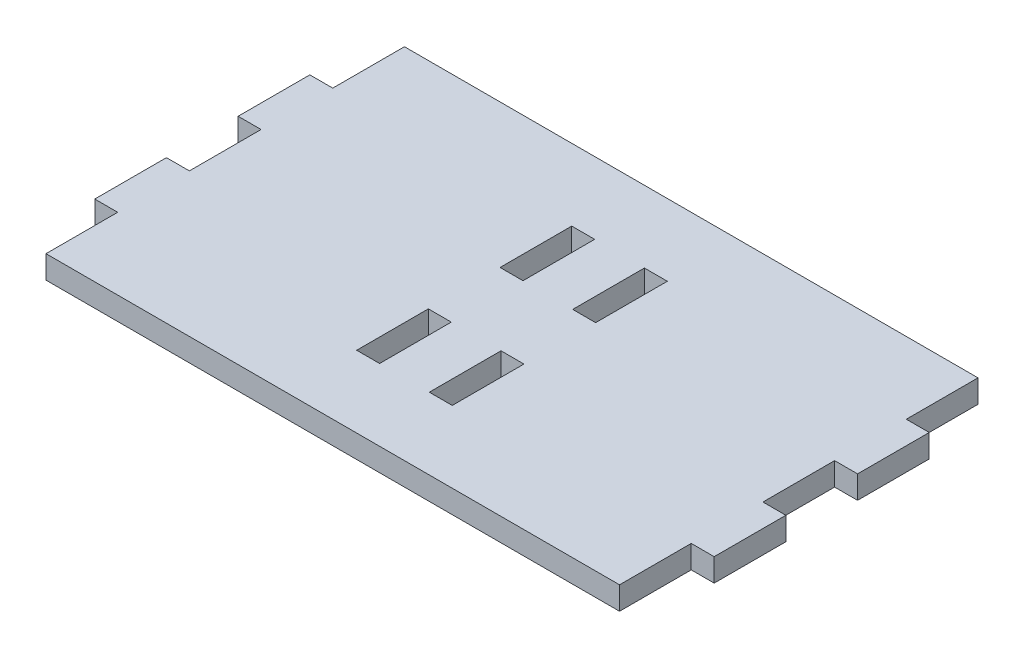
ISO-10303-21;
HEADER;
FILE_DESCRIPTION(('STEP AP214'),'2;1');
FILE_NAME('part.step','',(''),(''),'','','');
FILE_SCHEMA(('AUTOMOTIVE_DESIGN { 1 0 10303 214 1 1 1 1 }'));
ENDSEC;
DATA;
#1=APPLICATION_CONTEXT('core data for automotive mechanical design processes');
#2=APPLICATION_PROTOCOL_DEFINITION('international standard','automotive_design',2000,#1);
#3=PRODUCT_CONTEXT('',#1,'mechanical');
#4=PRODUCT('Part','Part','',(#3));
#5=PRODUCT_RELATED_PRODUCT_CATEGORY('part','',(#4));
#6=PRODUCT_DEFINITION_FORMATION('','',#4);
#7=PRODUCT_DEFINITION_CONTEXT('part definition',#1,'design');
#8=PRODUCT_DEFINITION('design','',#6,#7);
#9=PRODUCT_DEFINITION_SHAPE('','',#8);
#10=(LENGTH_UNIT() NAMED_UNIT(*) SI_UNIT(.MILLI.,.METRE.));
#11=(NAMED_UNIT(*) PLANE_ANGLE_UNIT() SI_UNIT($,.RADIAN.));
#12=(NAMED_UNIT(*) SI_UNIT($,.STERADIAN.) SOLID_ANGLE_UNIT());
#13=UNCERTAINTY_MEASURE_WITH_UNIT(LENGTH_MEASURE(1.E-05),#10,'distance_accuracy_value','');
#14=(GEOMETRIC_REPRESENTATION_CONTEXT(3) GLOBAL_UNCERTAINTY_ASSIGNED_CONTEXT((#13)) GLOBAL_UNIT_ASSIGNED_CONTEXT((#10,
#11,#12)) REPRESENTATION_CONTEXT('',''));
#15=CARTESIAN_POINT('',(0.,0.,0.));
#16=DIRECTION('',(0.,0.,1.));
#17=DIRECTION('',(1.,0.,0.));
#18=AXIS2_PLACEMENT_3D('',#15,#16,#17);
#19=CARTESIAN_POINT('',(0.,12.,0.));
#20=DIRECTION('',(0.,-1.,0.));
#21=DIRECTION('',(0.,0.,-1.));
#22=AXIS2_PLACEMENT_3D('',#19,#20,#21);
#23=PLANE('',#22);
#24=DIRECTION('',(-1.,0.,0.));
#25=VECTOR('',#24,1.);
#26=CARTESIAN_POINT('',(-24.9999999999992,12.,18.75));
#27=LINE('',#26,#25);
#28=CARTESIAN_POINT('',(-12.9999999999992,12.,18.75));
#29=VERTEX_POINT('',#28);
#30=CARTESIAN_POINT('',(-24.9999999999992,12.,18.75));
#31=VERTEX_POINT('',#30);
#32=EDGE_CURVE('E327',#29,#31,#27,.T.);
#33=ORIENTED_EDGE('',*,*,#32,.F.);
#34=DIRECTION('',(0.,0.,-1.));
#35=VECTOR('',#34,1.);
#36=CARTESIAN_POINT('',(-12.9999999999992,12.,18.75));
#37=LINE('',#36,#35);
#38=CARTESIAN_POINT('',(-12.9999999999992,12.,56.25));
#39=VERTEX_POINT('',#38);
#40=EDGE_CURVE('E338',#39,#29,#37,.T.);
#41=ORIENTED_EDGE('',*,*,#40,.F.);
#42=DIRECTION('',(1.,0.,0.));
#43=VECTOR('',#42,1.);
#44=CARTESIAN_POINT('',(-24.9999999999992,12.,56.25));
#45=LINE('',#44,#43);
#46=CARTESIAN_POINT('',(-24.9999999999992,12.,56.25));
#47=VERTEX_POINT('',#46);
#48=EDGE_CURVE('E334',#47,#39,#45,.T.);
#49=ORIENTED_EDGE('',*,*,#48,.F.);
#50=DIRECTION('',(0.,0.,1.));
#51=VECTOR('',#50,1.);
#52=CARTESIAN_POINT('',(-24.9999999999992,12.,18.75));
#53=LINE('',#52,#51);
#54=EDGE_CURVE('E330',#31,#47,#53,.T.);
#55=ORIENTED_EDGE('',*,*,#54,.F.);
#56=EDGE_LOOP('',(#33,#41,#49,#55));
#57=FACE_BOUND('',#56,.T.);
#58=DIRECTION('',(0.,0.,1.));
#59=VECTOR('',#58,1.);
#60=CARTESIAN_POINT('',(-25.,12.,-56.25));
#61=LINE('',#60,#59);
#62=CARTESIAN_POINT('',(-25.,12.,-56.25));
#63=VERTEX_POINT('',#62);
#64=CARTESIAN_POINT('',(-25.,12.,-18.75));
#65=VERTEX_POINT('',#64);
#66=EDGE_CURVE('E413',#63,#65,#61,.T.);
#67=ORIENTED_EDGE('',*,*,#66,.F.);
#68=DIRECTION('',(-1.,0.,0.));
#69=VECTOR('',#68,1.);
#70=CARTESIAN_POINT('',(-25.,12.,-56.25));
#71=LINE('',#70,#69);
#72=CARTESIAN_POINT('',(-13.,12.,-56.25));
#73=VERTEX_POINT('',#72);
#74=EDGE_CURVE('E424',#73,#63,#71,.T.);
#75=ORIENTED_EDGE('',*,*,#74,.F.);
#76=DIRECTION('',(0.,0.,-1.));
#77=VECTOR('',#76,1.);
#78=CARTESIAN_POINT('',(-13.,12.,-56.25));
#79=LINE('',#78,#77);
#80=CARTESIAN_POINT('',(-13.,12.,-18.75));
#81=VERTEX_POINT('',#80);
#82=EDGE_CURVE('E420',#81,#73,#79,.T.);
#83=ORIENTED_EDGE('',*,*,#82,.F.);
#84=DIRECTION('',(1.,0.,0.));
#85=VECTOR('',#84,1.);
#86=CARTESIAN_POINT('',(-25.,12.,-18.75));
#87=LINE('',#86,#85);
#88=EDGE_CURVE('E416',#65,#81,#87,.T.);
#89=ORIENTED_EDGE('',*,*,#88,.F.);
#90=EDGE_LOOP('',(#67,#75,#83,#89));
#91=FACE_BOUND('',#90,.T.);
#92=DIRECTION('',(0.,0.,-1.));
#93=VECTOR('',#92,1.);
#94=CARTESIAN_POINT('',(150.,12.,-56.25));
#95=LINE('',#94,#93);
#96=CARTESIAN_POINT('',(150.,12.,-56.25));
#97=VERTEX_POINT('',#96);
#98=CARTESIAN_POINT('',(150.,12.,-93.75));
#99=VERTEX_POINT('',#98);
#100=EDGE_CURVE('E456',#97,#99,#95,.T.);
#101=ORIENTED_EDGE('',*,*,#100,.T.);
#102=DIRECTION('',(-1.,0.,0.));
#103=VECTOR('',#102,1.);
#104=CARTESIAN_POINT('',(-150.,12.,-93.75));
#105=LINE('',#104,#103);
#106=CARTESIAN_POINT('',(-150.,12.,-93.75));
#107=VERTEX_POINT('',#106);
#108=EDGE_CURVE('E460',#99,#107,#105,.T.);
#109=ORIENTED_EDGE('',*,*,#108,.T.);
#110=DIRECTION('',(0.,0.,1.));
#111=VECTOR('',#110,1.);
#112=CARTESIAN_POINT('',(-150.,12.,-56.25));
#113=LINE('',#112,#111);
#114=CARTESIAN_POINT('',(-150.,12.,-56.25));
#115=VERTEX_POINT('',#114);
#116=EDGE_CURVE('E464',#107,#115,#113,.T.);
#117=ORIENTED_EDGE('',*,*,#116,.T.);
#118=DIRECTION('',(-1.,0.,0.));
#119=VECTOR('',#118,1.);
#120=CARTESIAN_POINT('',(-150.,12.,-56.25));
#121=LINE('',#120,#119);
#122=CARTESIAN_POINT('',(-162.,12.,-56.25));
#123=VERTEX_POINT('',#122);
#124=EDGE_CURVE('E467',#115,#123,#121,.T.);
#125=ORIENTED_EDGE('',*,*,#124,.T.);
#126=DIRECTION('',(0.,0.,1.));
#127=VECTOR('',#126,1.);
#128=CARTESIAN_POINT('',(-162.,12.,-18.75));
#129=LINE('',#128,#127);
#130=CARTESIAN_POINT('',(-162.,12.,-18.75));
#131=VERTEX_POINT('',#130);
#132=EDGE_CURVE('E470',#123,#131,#129,.T.);
#133=ORIENTED_EDGE('',*,*,#132,.T.);
#134=DIRECTION('',(1.,0.,0.));
#135=VECTOR('',#134,1.);
#136=CARTESIAN_POINT('',(-150.,12.,-18.75));
#137=LINE('',#136,#135);
#138=CARTESIAN_POINT('',(-150.,12.,-18.75));
#139=VERTEX_POINT('',#138);
#140=EDGE_CURVE('E473',#131,#139,#137,.T.);
#141=ORIENTED_EDGE('',*,*,#140,.T.);
#142=DIRECTION('',(0.,0.,1.));
#143=VECTOR('',#142,1.);
#144=CARTESIAN_POINT('',(-150.,12.,18.75));
#145=LINE('',#144,#143);
#146=CARTESIAN_POINT('',(-150.,12.,18.75));
#147=VERTEX_POINT('',#146);
#148=EDGE_CURVE('E476',#139,#147,#145,.T.);
#149=ORIENTED_EDGE('',*,*,#148,.T.);
#150=DIRECTION('',(-1.,0.,0.));
#151=VECTOR('',#150,1.);
#152=CARTESIAN_POINT('',(-150.,12.,18.75));
#153=LINE('',#152,#151);
#154=CARTESIAN_POINT('',(-162.,12.,18.75));
#155=VERTEX_POINT('',#154);
#156=EDGE_CURVE('E479',#147,#155,#153,.T.);
#157=ORIENTED_EDGE('',*,*,#156,.T.);
#158=DIRECTION('',(0.,0.,1.));
#159=VECTOR('',#158,1.);
#160=CARTESIAN_POINT('',(-162.,12.,56.25));
#161=LINE('',#160,#159);
#162=CARTESIAN_POINT('',(-162.,12.,56.25));
#163=VERTEX_POINT('',#162);
#164=EDGE_CURVE('E482',#155,#163,#161,.T.);
#165=ORIENTED_EDGE('',*,*,#164,.T.);
#166=DIRECTION('',(1.,0.,0.));
#167=VECTOR('',#166,1.);
#168=CARTESIAN_POINT('',(-150.,12.,56.25));
#169=LINE('',#168,#167);
#170=CARTESIAN_POINT('',(-150.,12.,56.25));
#171=VERTEX_POINT('',#170);
#172=EDGE_CURVE('E485',#163,#171,#169,.T.);
#173=ORIENTED_EDGE('',*,*,#172,.T.);
#174=DIRECTION('',(0.,0.,1.));
#175=VECTOR('',#174,1.);
#176=CARTESIAN_POINT('',(-150.,12.,93.75));
#177=LINE('',#176,#175);
#178=CARTESIAN_POINT('',(-150.,12.,93.75));
#179=VERTEX_POINT('',#178);
#180=EDGE_CURVE('E488',#171,#179,#177,.T.);
#181=ORIENTED_EDGE('',*,*,#180,.T.);
#182=DIRECTION('',(1.,0.,0.));
#183=VECTOR('',#182,1.);
#184=CARTESIAN_POINT('',(-150.,12.,93.75));
#185=LINE('',#184,#183);
#186=CARTESIAN_POINT('',(150.,12.,93.75));
#187=VERTEX_POINT('',#186);
#188=EDGE_CURVE('E491',#179,#187,#185,.T.);
#189=ORIENTED_EDGE('',*,*,#188,.T.);
#190=DIRECTION('',(0.,0.,-1.));
#191=VECTOR('',#190,1.);
#192=CARTESIAN_POINT('',(150.,12.,93.75));
#193=LINE('',#192,#191);
#194=CARTESIAN_POINT('',(150.,12.,56.25));
#195=VERTEX_POINT('',#194);
#196=EDGE_CURVE('E494',#187,#195,#193,.T.);
#197=ORIENTED_EDGE('',*,*,#196,.T.);
#198=DIRECTION('',(1.,0.,0.));
#199=VECTOR('',#198,1.);
#200=CARTESIAN_POINT('',(150.,12.,56.25));
#201=LINE('',#200,#199);
#202=CARTESIAN_POINT('',(162.,12.,56.25));
#203=VERTEX_POINT('',#202);
#204=EDGE_CURVE('E497',#195,#203,#201,.T.);
#205=ORIENTED_EDGE('',*,*,#204,.T.);
#206=DIRECTION('',(0.,0.,-1.));
#207=VECTOR('',#206,1.);
#208=CARTESIAN_POINT('',(162.,12.,56.25));
#209=LINE('',#208,#207);
#210=CARTESIAN_POINT('',(162.,12.,18.75));
#211=VERTEX_POINT('',#210);
#212=EDGE_CURVE('E500',#203,#211,#209,.T.);
#213=ORIENTED_EDGE('',*,*,#212,.T.);
#214=DIRECTION('',(-1.,0.,0.));
#215=VECTOR('',#214,1.);
#216=CARTESIAN_POINT('',(150.,12.,18.75));
#217=LINE('',#216,#215);
#218=CARTESIAN_POINT('',(150.,12.,18.75));
#219=VERTEX_POINT('',#218);
#220=EDGE_CURVE('E503',#211,#219,#217,.T.);
#221=ORIENTED_EDGE('',*,*,#220,.T.);
#222=DIRECTION('',(0.,0.,-1.));
#223=VECTOR('',#222,1.);
#224=CARTESIAN_POINT('',(150.,12.,18.75));
#225=LINE('',#224,#223);
#226=CARTESIAN_POINT('',(150.,12.,-18.75));
#227=VERTEX_POINT('',#226);
#228=EDGE_CURVE('E506',#219,#227,#225,.T.);
#229=ORIENTED_EDGE('',*,*,#228,.T.);
#230=DIRECTION('',(1.,0.,0.));
#231=VECTOR('',#230,1.);
#232=CARTESIAN_POINT('',(150.,12.,-18.75));
#233=LINE('',#232,#231);
#234=CARTESIAN_POINT('',(162.,12.,-18.75));
#235=VERTEX_POINT('',#234);
#236=EDGE_CURVE('E509',#227,#235,#233,.T.);
#237=ORIENTED_EDGE('',*,*,#236,.T.);
#238=DIRECTION('',(0.,0.,-1.));
#239=VECTOR('',#238,1.);
#240=CARTESIAN_POINT('',(162.,12.,-18.75));
#241=LINE('',#240,#239);
#242=CARTESIAN_POINT('',(162.,12.,-56.25));
#243=VERTEX_POINT('',#242);
#244=EDGE_CURVE('E512',#235,#243,#241,.T.);
#245=ORIENTED_EDGE('',*,*,#244,.T.);
#246=DIRECTION('',(-1.,0.,0.));
#247=VECTOR('',#246,1.);
#248=CARTESIAN_POINT('',(150.,12.,-56.25));
#249=LINE('',#248,#247);
#250=EDGE_CURVE('E515',#243,#97,#249,.T.);
#251=ORIENTED_EDGE('',*,*,#250,.T.);
#252=EDGE_LOOP('',(#101,#109,#117,#125,#133,#141,#149,#157,#165,#173,#181,#189,#197,#205,#213,
#221,#229,#237,#245,#251));
#253=FACE_BOUND('',#252,.T.);
#254=DIRECTION('',(0.,0.,-1.));
#255=VECTOR('',#254,1.);
#256=CARTESIAN_POINT('',(24.9999999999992,12.,18.75));
#257=LINE('',#256,#255);
#258=CARTESIAN_POINT('',(24.9999999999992,12.,56.25));
#259=VERTEX_POINT('',#258);
#260=CARTESIAN_POINT('',(24.9999999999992,12.,18.75));
#261=VERTEX_POINT('',#260);
#262=EDGE_CURVE('E370',#259,#261,#257,.T.);
#263=ORIENTED_EDGE('',*,*,#262,.F.);
#264=DIRECTION('',(1.,0.,0.));
#265=VECTOR('',#264,1.);
#266=CARTESIAN_POINT('',(24.9999999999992,12.,56.25));
#267=LINE('',#266,#265);
#268=CARTESIAN_POINT('',(12.9999999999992,12.,56.25));
#269=VERTEX_POINT('',#268);
#270=EDGE_CURVE('E381',#269,#259,#267,.T.);
#271=ORIENTED_EDGE('',*,*,#270,.F.);
#272=DIRECTION('',(0.,0.,1.));
#273=VECTOR('',#272,1.);
#274=CARTESIAN_POINT('',(12.9999999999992,12.,18.75));
#275=LINE('',#274,#273);
#276=CARTESIAN_POINT('',(12.9999999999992,12.,18.75));
#277=VERTEX_POINT('',#276);
#278=EDGE_CURVE('E377',#277,#269,#275,.T.);
#279=ORIENTED_EDGE('',*,*,#278,.F.);
#280=DIRECTION('',(-1.,0.,0.));
#281=VECTOR('',#280,1.);
#282=CARTESIAN_POINT('',(24.9999999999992,12.,18.75));
#283=LINE('',#282,#281);
#284=EDGE_CURVE('E373',#261,#277,#283,.T.);
#285=ORIENTED_EDGE('',*,*,#284,.F.);
#286=EDGE_LOOP('',(#263,#271,#279,#285));
#287=FACE_BOUND('',#286,.T.);
#288=DIRECTION('',(0.,0.,-1.));
#289=VECTOR('',#288,1.);
#290=CARTESIAN_POINT('',(25.,12.,-56.25));
#291=LINE('',#290,#289);
#292=CARTESIAN_POINT('',(25.,12.,-18.75));
#293=VERTEX_POINT('',#292);
#294=CARTESIAN_POINT('',(25.,12.,-56.25));
#295=VERTEX_POINT('',#294);
#296=EDGE_CURVE('E279',#293,#295,#291,.T.);
#297=ORIENTED_EDGE('',*,*,#296,.F.);
#298=DIRECTION('',(1.,0.,0.));
#299=VECTOR('',#298,1.);
#300=CARTESIAN_POINT('',(25.,12.,-18.75));
#301=LINE('',#300,#299);
#302=CARTESIAN_POINT('',(13.,12.,-18.75));
#303=VERTEX_POINT('',#302);
#304=EDGE_CURVE('E305',#303,#293,#301,.T.);
#305=ORIENTED_EDGE('',*,*,#304,.F.);
#306=DIRECTION('',(0.,0.,1.));
#307=VECTOR('',#306,1.);
#308=CARTESIAN_POINT('',(13.,12.,-56.25));
#309=LINE('',#308,#307);
#310=CARTESIAN_POINT('',(13.,12.,-56.25));
#311=VERTEX_POINT('',#310);
#312=EDGE_CURVE('E301',#311,#303,#309,.T.);
#313=ORIENTED_EDGE('',*,*,#312,.F.);
#314=DIRECTION('',(-1.,0.,0.));
#315=VECTOR('',#314,1.);
#316=CARTESIAN_POINT('',(25.,12.,-56.25));
#317=LINE('',#316,#315);
#318=EDGE_CURVE('E288',#295,#311,#317,.T.);
#319=ORIENTED_EDGE('',*,*,#318,.F.);
#320=EDGE_LOOP('',(#297,#305,#313,#319));
#321=FACE_BOUND('',#320,.T.);
#322=ADVANCED_FACE('F45',(#57,#91,#253,#287,#321),#23,.F.);
#323=CARTESIAN_POINT('',(0.,0.,0.));
#324=DIRECTION('',(0.,-1.,0.));
#325=DIRECTION('',(0.,0.,-1.));
#326=AXIS2_PLACEMENT_3D('',#323,#324,#325);
#327=PLANE('',#326);
#328=DIRECTION('',(0.,0.,-1.));
#329=VECTOR('',#328,1.);
#330=CARTESIAN_POINT('',(150.,0.,-56.25));
#331=LINE('',#330,#329);
#332=CARTESIAN_POINT('',(150.,0.,-56.25));
#333=VERTEX_POINT('',#332);
#334=CARTESIAN_POINT('',(150.,0.,-93.75));
#335=VERTEX_POINT('',#334);
#336=EDGE_CURVE('E455',#333,#335,#331,.T.);
#337=ORIENTED_EDGE('',*,*,#336,.F.);
#338=DIRECTION('',(-1.,0.,0.));
#339=VECTOR('',#338,1.);
#340=CARTESIAN_POINT('',(150.,0.,-56.25));
#341=LINE('',#340,#339);
#342=CARTESIAN_POINT('',(162.,0.,-56.25));
#343=VERTEX_POINT('',#342);
#344=EDGE_CURVE('E461',#343,#333,#341,.T.);
#345=ORIENTED_EDGE('',*,*,#344,.F.);
#346=DIRECTION('',(0.,0.,-1.));
#347=VECTOR('',#346,1.);
#348=CARTESIAN_POINT('',(162.,0.,-18.75));
#349=LINE('',#348,#347);
#350=CARTESIAN_POINT('',(162.,0.,-18.75));
#351=VERTEX_POINT('',#350);
#352=EDGE_CURVE('E573',#351,#343,#349,.T.);
#353=ORIENTED_EDGE('',*,*,#352,.F.);
#354=DIRECTION('',(1.,0.,0.));
#355=VECTOR('',#354,1.);
#356=CARTESIAN_POINT('',(150.,0.,-18.75));
#357=LINE('',#356,#355);
#358=CARTESIAN_POINT('',(150.,0.,-18.75));
#359=VERTEX_POINT('',#358);
#360=EDGE_CURVE('E570',#359,#351,#357,.T.);
#361=ORIENTED_EDGE('',*,*,#360,.F.);
#362=DIRECTION('',(0.,0.,-1.));
#363=VECTOR('',#362,1.);
#364=CARTESIAN_POINT('',(150.,0.,18.75));
#365=LINE('',#364,#363);
#366=CARTESIAN_POINT('',(150.,0.,18.75));
#367=VERTEX_POINT('',#366);
#368=EDGE_CURVE('E567',#367,#359,#365,.T.);
#369=ORIENTED_EDGE('',*,*,#368,.F.);
#370=DIRECTION('',(-1.,0.,0.));
#371=VECTOR('',#370,1.);
#372=CARTESIAN_POINT('',(150.,0.,18.75));
#373=LINE('',#372,#371);
#374=CARTESIAN_POINT('',(162.,0.,18.75));
#375=VERTEX_POINT('',#374);
#376=EDGE_CURVE('E564',#375,#367,#373,.T.);
#377=ORIENTED_EDGE('',*,*,#376,.F.);
#378=DIRECTION('',(0.,0.,-1.));
#379=VECTOR('',#378,1.);
#380=CARTESIAN_POINT('',(162.,0.,56.25));
#381=LINE('',#380,#379);
#382=CARTESIAN_POINT('',(162.,0.,56.25));
#383=VERTEX_POINT('',#382);
#384=EDGE_CURVE('E561',#383,#375,#381,.T.);
#385=ORIENTED_EDGE('',*,*,#384,.F.);
#386=DIRECTION('',(1.,0.,0.));
#387=VECTOR('',#386,1.);
#388=CARTESIAN_POINT('',(150.,0.,56.25));
#389=LINE('',#388,#387);
#390=CARTESIAN_POINT('',(150.,0.,56.25));
#391=VERTEX_POINT('',#390);
#392=EDGE_CURVE('E558',#391,#383,#389,.T.);
#393=ORIENTED_EDGE('',*,*,#392,.F.);
#394=DIRECTION('',(0.,0.,-1.));
#395=VECTOR('',#394,1.);
#396=CARTESIAN_POINT('',(150.,0.,93.75));
#397=LINE('',#396,#395);
#398=CARTESIAN_POINT('',(150.,0.,93.75));
#399=VERTEX_POINT('',#398);
#400=EDGE_CURVE('E555',#399,#391,#397,.T.);
#401=ORIENTED_EDGE('',*,*,#400,.F.);
#402=DIRECTION('',(1.,0.,0.));
#403=VECTOR('',#402,1.);
#404=CARTESIAN_POINT('',(-150.,0.,93.75));
#405=LINE('',#404,#403);
#406=CARTESIAN_POINT('',(-150.,0.,93.75));
#407=VERTEX_POINT('',#406);
#408=EDGE_CURVE('E552',#407,#399,#405,.T.);
#409=ORIENTED_EDGE('',*,*,#408,.F.);
#410=DIRECTION('',(0.,0.,1.));
#411=VECTOR('',#410,1.);
#412=CARTESIAN_POINT('',(-150.,0.,93.75));
#413=LINE('',#412,#411);
#414=CARTESIAN_POINT('',(-150.,0.,56.25));
#415=VERTEX_POINT('',#414);
#416=EDGE_CURVE('E549',#415,#407,#413,.T.);
#417=ORIENTED_EDGE('',*,*,#416,.F.);
#418=DIRECTION('',(1.,0.,0.));
#419=VECTOR('',#418,1.);
#420=CARTESIAN_POINT('',(-150.,0.,56.25));
#421=LINE('',#420,#419);
#422=CARTESIAN_POINT('',(-162.,0.,56.25));
#423=VERTEX_POINT('',#422);
#424=EDGE_CURVE('E546',#423,#415,#421,.T.);
#425=ORIENTED_EDGE('',*,*,#424,.F.);
#426=DIRECTION('',(0.,0.,1.));
#427=VECTOR('',#426,1.);
#428=CARTESIAN_POINT('',(-162.,0.,56.25));
#429=LINE('',#428,#427);
#430=CARTESIAN_POINT('',(-162.,0.,18.75));
#431=VERTEX_POINT('',#430);
#432=EDGE_CURVE('E543',#431,#423,#429,.T.);
#433=ORIENTED_EDGE('',*,*,#432,.F.);
#434=DIRECTION('',(-1.,0.,0.));
#435=VECTOR('',#434,1.);
#436=CARTESIAN_POINT('',(-150.,0.,18.75));
#437=LINE('',#436,#435);
#438=CARTESIAN_POINT('',(-150.,0.,18.75));
#439=VERTEX_POINT('',#438);
#440=EDGE_CURVE('E540',#439,#431,#437,.T.);
#441=ORIENTED_EDGE('',*,*,#440,.F.);
#442=DIRECTION('',(0.,0.,1.));
#443=VECTOR('',#442,1.);
#444=CARTESIAN_POINT('',(-150.,0.,18.75));
#445=LINE('',#444,#443);
#446=CARTESIAN_POINT('',(-150.,0.,-18.75));
#447=VERTEX_POINT('',#446);
#448=EDGE_CURVE('E537',#447,#439,#445,.T.);
#449=ORIENTED_EDGE('',*,*,#448,.F.);
#450=DIRECTION('',(1.,0.,0.));
#451=VECTOR('',#450,1.);
#452=CARTESIAN_POINT('',(-150.,0.,-18.75));
#453=LINE('',#452,#451);
#454=CARTESIAN_POINT('',(-162.,0.,-18.75));
#455=VERTEX_POINT('',#454);
#456=EDGE_CURVE('E534',#455,#447,#453,.T.);
#457=ORIENTED_EDGE('',*,*,#456,.F.);
#458=DIRECTION('',(0.,0.,1.));
#459=VECTOR('',#458,1.);
#460=CARTESIAN_POINT('',(-162.,0.,-18.75));
#461=LINE('',#460,#459);
#462=CARTESIAN_POINT('',(-162.,0.,-56.25));
#463=VERTEX_POINT('',#462);
#464=EDGE_CURVE('E531',#463,#455,#461,.T.);
#465=ORIENTED_EDGE('',*,*,#464,.F.);
#466=DIRECTION('',(-1.,0.,0.));
#467=VECTOR('',#466,1.);
#468=CARTESIAN_POINT('',(-150.,0.,-56.25));
#469=LINE('',#468,#467);
#470=CARTESIAN_POINT('',(-150.,0.,-56.25));
#471=VERTEX_POINT('',#470);
#472=EDGE_CURVE('E528',#471,#463,#469,.T.);
#473=ORIENTED_EDGE('',*,*,#472,.F.);
#474=DIRECTION('',(0.,0.,1.));
#475=VECTOR('',#474,1.);
#476=CARTESIAN_POINT('',(-150.,0.,-56.25));
#477=LINE('',#476,#475);
#478=CARTESIAN_POINT('',(-150.,0.,-93.75));
#479=VERTEX_POINT('',#478);
#480=EDGE_CURVE('E525',#479,#471,#477,.T.);
#481=ORIENTED_EDGE('',*,*,#480,.F.);
#482=DIRECTION('',(-1.,0.,0.));
#483=VECTOR('',#482,1.);
#484=CARTESIAN_POINT('',(-150.,0.,-93.75));
#485=LINE('',#484,#483);
#486=EDGE_CURVE('E522',#335,#479,#485,.T.);
#487=ORIENTED_EDGE('',*,*,#486,.F.);
#488=EDGE_LOOP('',(#337,#345,#353,#361,#369,#377,#385,#393,#401,#409,#417,#425,#433,#441,#449,
#457,#465,#473,#481,#487));
#489=FACE_BOUND('',#488,.T.);
#490=DIRECTION('',(-1.,0.,0.));
#491=VECTOR('',#490,1.);
#492=CARTESIAN_POINT('',(-25.,0.,-56.25));
#493=LINE('',#492,#491);
#494=CARTESIAN_POINT('',(-13.,0.,-56.25));
#495=VERTEX_POINT('',#494);
#496=CARTESIAN_POINT('',(-25.,0.,-56.25));
#497=VERTEX_POINT('',#496);
#498=EDGE_CURVE('E417',#495,#497,#493,.T.);
#499=ORIENTED_EDGE('',*,*,#498,.T.);
#500=DIRECTION('',(0.,0.,1.));
#501=VECTOR('',#500,1.);
#502=CARTESIAN_POINT('',(-25.,0.,-56.25));
#503=LINE('',#502,#501);
#504=CARTESIAN_POINT('',(-25.,0.,-18.75));
#505=VERTEX_POINT('',#504);
#506=EDGE_CURVE('E412',#497,#505,#503,.T.);
#507=ORIENTED_EDGE('',*,*,#506,.T.);
#508=DIRECTION('',(1.,0.,0.));
#509=VECTOR('',#508,1.);
#510=CARTESIAN_POINT('',(-25.,0.,-18.75));
#511=LINE('',#510,#509);
#512=CARTESIAN_POINT('',(-13.,0.,-18.75));
#513=VERTEX_POINT('',#512);
#514=EDGE_CURVE('E431',#505,#513,#511,.T.);
#515=ORIENTED_EDGE('',*,*,#514,.T.);
#516=DIRECTION('',(0.,0.,-1.));
#517=VECTOR('',#516,1.);
#518=CARTESIAN_POINT('',(-13.,0.,-56.25));
#519=LINE('',#518,#517);
#520=EDGE_CURVE('E435',#513,#495,#519,.T.);
#521=ORIENTED_EDGE('',*,*,#520,.T.);
#522=EDGE_LOOP('',(#499,#507,#515,#521));
#523=FACE_BOUND('',#522,.T.);
#524=DIRECTION('',(1.,0.,0.));
#525=VECTOR('',#524,1.);
#526=CARTESIAN_POINT('',(24.9999999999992,0.,56.25));
#527=LINE('',#526,#525);
#528=CARTESIAN_POINT('',(12.9999999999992,0.,56.25));
#529=VERTEX_POINT('',#528);
#530=CARTESIAN_POINT('',(24.9999999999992,0.,56.25));
#531=VERTEX_POINT('',#530);
#532=EDGE_CURVE('E374',#529,#531,#527,.T.);
#533=ORIENTED_EDGE('',*,*,#532,.T.);
#534=DIRECTION('',(0.,0.,-1.));
#535=VECTOR('',#534,1.);
#536=CARTESIAN_POINT('',(24.9999999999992,0.,18.75));
#537=LINE('',#536,#535);
#538=CARTESIAN_POINT('',(24.9999999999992,0.,18.75));
#539=VERTEX_POINT('',#538);
#540=EDGE_CURVE('E369',#531,#539,#537,.T.);
#541=ORIENTED_EDGE('',*,*,#540,.T.);
#542=DIRECTION('',(-1.,0.,0.));
#543=VECTOR('',#542,1.);
#544=CARTESIAN_POINT('',(24.9999999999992,0.,18.75));
#545=LINE('',#544,#543);
#546=CARTESIAN_POINT('',(12.9999999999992,0.,18.75));
#547=VERTEX_POINT('',#546);
#548=EDGE_CURVE('E388',#539,#547,#545,.T.);
#549=ORIENTED_EDGE('',*,*,#548,.T.);
#550=DIRECTION('',(0.,0.,1.));
#551=VECTOR('',#550,1.);
#552=CARTESIAN_POINT('',(12.9999999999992,0.,18.75));
#553=LINE('',#552,#551);
#554=EDGE_CURVE('E392',#547,#529,#553,.T.);
#555=ORIENTED_EDGE('',*,*,#554,.T.);
#556=EDGE_LOOP('',(#533,#541,#549,#555));
#557=FACE_BOUND('',#556,.T.);
#558=DIRECTION('',(0.,0.,-1.));
#559=VECTOR('',#558,1.);
#560=CARTESIAN_POINT('',(-12.9999999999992,0.,18.75));
#561=LINE('',#560,#559);
#562=CARTESIAN_POINT('',(-12.9999999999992,0.,56.25));
#563=VERTEX_POINT('',#562);
#564=CARTESIAN_POINT('',(-12.9999999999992,0.,18.75));
#565=VERTEX_POINT('',#564);
#566=EDGE_CURVE('E331',#563,#565,#561,.T.);
#567=ORIENTED_EDGE('',*,*,#566,.T.);
#568=DIRECTION('',(-1.,0.,0.));
#569=VECTOR('',#568,1.);
#570=CARTESIAN_POINT('',(-24.9999999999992,0.,18.75));
#571=LINE('',#570,#569);
#572=CARTESIAN_POINT('',(-24.9999999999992,0.,18.75));
#573=VERTEX_POINT('',#572);
#574=EDGE_CURVE('E297',#565,#573,#571,.T.);
#575=ORIENTED_EDGE('',*,*,#574,.T.);
#576=DIRECTION('',(0.,0.,1.));
#577=VECTOR('',#576,1.);
#578=CARTESIAN_POINT('',(-24.9999999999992,0.,18.75));
#579=LINE('',#578,#577);
#580=CARTESIAN_POINT('',(-24.9999999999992,0.,56.25));
#581=VERTEX_POINT('',#580);
#582=EDGE_CURVE('E345',#573,#581,#579,.T.);
#583=ORIENTED_EDGE('',*,*,#582,.T.);
#584=DIRECTION('',(1.,0.,0.));
#585=VECTOR('',#584,1.);
#586=CARTESIAN_POINT('',(-24.9999999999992,0.,56.25));
#587=LINE('',#586,#585);
#588=EDGE_CURVE('E349',#581,#563,#587,.T.);
#589=ORIENTED_EDGE('',*,*,#588,.T.);
#590=EDGE_LOOP('',(#567,#575,#583,#589));
#591=FACE_BOUND('',#590,.T.);
#592=DIRECTION('',(1.,0.,0.));
#593=VECTOR('',#592,1.);
#594=CARTESIAN_POINT('',(25.,0.,-18.75));
#595=LINE('',#594,#593);
#596=CARTESIAN_POINT('',(13.,0.,-18.75));
#597=VERTEX_POINT('',#596);
#598=CARTESIAN_POINT('',(25.,0.,-18.75));
#599=VERTEX_POINT('',#598);
#600=EDGE_CURVE('E289',#597,#599,#595,.T.);
#601=ORIENTED_EDGE('',*,*,#600,.T.);
#602=DIRECTION('',(0.,0.,-1.));
#603=VECTOR('',#602,1.);
#604=CARTESIAN_POINT('',(25.,0.,-56.25));
#605=LINE('',#604,#603);
#606=CARTESIAN_POINT('',(25.,0.,-56.25));
#607=VERTEX_POINT('',#606);
#608=EDGE_CURVE('E69',#599,#607,#605,.T.);
#609=ORIENTED_EDGE('',*,*,#608,.T.);
#610=DIRECTION('',(-1.,0.,0.));
#611=VECTOR('',#610,1.);
#612=CARTESIAN_POINT('',(25.,0.,-56.25));
#613=LINE('',#612,#611);
#614=CARTESIAN_POINT('',(13.,0.,-56.25));
#615=VERTEX_POINT('',#614);
#616=EDGE_CURVE('E295',#607,#615,#613,.T.);
#617=ORIENTED_EDGE('',*,*,#616,.T.);
#618=DIRECTION('',(0.,0.,1.));
#619=VECTOR('',#618,1.);
#620=CARTESIAN_POINT('',(13.,0.,-56.25));
#621=LINE('',#620,#619);
#622=EDGE_CURVE('E314',#615,#597,#621,.T.);
#623=ORIENTED_EDGE('',*,*,#622,.T.);
#624=EDGE_LOOP('',(#601,#609,#617,#623));
#625=FACE_BOUND('',#624,.T.);
#626=ADVANCED_FACE('F660',(#489,#523,#557,#591,#625),#327,.T.);
#627=CARTESIAN_POINT('',(150.,12.,-56.25));
#628=DIRECTION('',(-1.,0.,0.));
#629=DIRECTION('',(0.,0.,1.));
#630=AXIS2_PLACEMENT_3D('',#627,#628,#629);
#631=PLANE('',#630);
#632=ORIENTED_EDGE('',*,*,#336,.T.);
#633=DIRECTION('',(0.,-1.,0.));
#634=VECTOR('',#633,1.);
#635=CARTESIAN_POINT('',(150.,12.,-93.75));
#636=LINE('',#635,#634);
#637=EDGE_CURVE('E11',#99,#335,#636,.T.);
#638=ORIENTED_EDGE('',*,*,#637,.F.);
#639=ORIENTED_EDGE('',*,*,#100,.F.);
#640=DIRECTION('',(0.,-1.,0.));
#641=VECTOR('',#640,1.);
#642=CARTESIAN_POINT('',(150.,12.,-56.25));
#643=LINE('',#642,#641);
#644=EDGE_CURVE('E518',#97,#333,#643,.T.);
#645=ORIENTED_EDGE('',*,*,#644,.T.);
#646=EDGE_LOOP('',(#632,#638,#639,#645));
#647=FACE_BOUND('',#646,.T.);
#648=ADVANCED_FACE('F47',(#647),#631,.F.);
#649=CARTESIAN_POINT('',(-150.,12.,-93.75));
#650=DIRECTION('',(0.,0.,1.));
#651=DIRECTION('',(1.,0.,0.));
#652=AXIS2_PLACEMENT_3D('',#649,#650,#651);
#653=PLANE('',#652);
#654=ORIENTED_EDGE('',*,*,#486,.T.);
#655=DIRECTION('',(0.,-1.,0.));
#656=VECTOR('',#655,1.);
#657=CARTESIAN_POINT('',(-150.,12.,-93.75));
#658=LINE('',#657,#656);
#659=EDGE_CURVE('E54',#107,#479,#658,.T.);
#660=ORIENTED_EDGE('',*,*,#659,.F.);
#661=ORIENTED_EDGE('',*,*,#108,.F.);
#662=ORIENTED_EDGE('',*,*,#637,.T.);
#663=EDGE_LOOP('',(#654,#660,#661,#662));
#664=FACE_BOUND('',#663,.T.);
#665=ADVANCED_FACE('F678',(#664),#653,.F.);
#666=CARTESIAN_POINT('',(-150.,12.,-56.25));
#667=DIRECTION('',(1.,0.,0.));
#668=DIRECTION('',(0.,0.,-1.));
#669=AXIS2_PLACEMENT_3D('',#666,#667,#668);
#670=PLANE('',#669);
#671=ORIENTED_EDGE('',*,*,#480,.T.);
#672=DIRECTION('',(0.,-1.,0.));
#673=VECTOR('',#672,1.);
#674=CARTESIAN_POINT('',(-150.,12.,-56.25));
#675=LINE('',#674,#673);
#676=EDGE_CURVE('E645',#115,#471,#675,.T.);
#677=ORIENTED_EDGE('',*,*,#676,.F.);
#678=ORIENTED_EDGE('',*,*,#116,.F.);
#679=ORIENTED_EDGE('',*,*,#659,.T.);
#680=EDGE_LOOP('',(#671,#677,#678,#679));
#681=FACE_BOUND('',#680,.T.);
#682=ADVANCED_FACE('F654',(#681),#670,.F.);
#683=CARTESIAN_POINT('',(-150.,12.,-56.25));
#684=DIRECTION('',(0.,0.,1.));
#685=DIRECTION('',(1.,0.,0.));
#686=AXIS2_PLACEMENT_3D('',#683,#684,#685);
#687=PLANE('',#686);
#688=ORIENTED_EDGE('',*,*,#472,.T.);
#689=DIRECTION('',(0.,-1.,0.));
#690=VECTOR('',#689,1.);
#691=CARTESIAN_POINT('',(-162.,12.,-56.25));
#692=LINE('',#691,#690);
#693=EDGE_CURVE('E641',#123,#463,#692,.T.);
#694=ORIENTED_EDGE('',*,*,#693,.F.);
#695=ORIENTED_EDGE('',*,*,#124,.F.);
#696=ORIENTED_EDGE('',*,*,#676,.T.);
#697=EDGE_LOOP('',(#688,#694,#695,#696));
#698=FACE_BOUND('',#697,.T.);
#699=ADVANCED_FACE('F666',(#698),#687,.F.);
#700=CARTESIAN_POINT('',(-162.,12.,-18.75));
#701=DIRECTION('',(1.,0.,0.));
#702=DIRECTION('',(0.,0.,-1.));
#703=AXIS2_PLACEMENT_3D('',#700,#701,#702);
#704=PLANE('',#703);
#705=ORIENTED_EDGE('',*,*,#464,.T.);
#706=DIRECTION('',(0.,-1.,0.));
#707=VECTOR('',#706,1.);
#708=CARTESIAN_POINT('',(-162.,12.,-18.75));
#709=LINE('',#708,#707);
#710=EDGE_CURVE('E637',#131,#455,#709,.T.);
#711=ORIENTED_EDGE('',*,*,#710,.F.);
#712=ORIENTED_EDGE('',*,*,#132,.F.);
#713=ORIENTED_EDGE('',*,*,#693,.T.);
#714=EDGE_LOOP('',(#705,#711,#712,#713));
#715=FACE_BOUND('',#714,.T.);
#716=ADVANCED_FACE('F670',(#715),#704,.F.);
#717=CARTESIAN_POINT('',(-150.,12.,-18.75));
#718=DIRECTION('',(0.,0.,-1.));
#719=DIRECTION('',(-1.,0.,0.));
#720=AXIS2_PLACEMENT_3D('',#717,#718,#719);
#721=PLANE('',#720);
#722=ORIENTED_EDGE('',*,*,#456,.T.);
#723=DIRECTION('',(0.,-1.,0.));
#724=VECTOR('',#723,1.);
#725=CARTESIAN_POINT('',(-150.,12.,-18.75));
#726=LINE('',#725,#724);
#727=EDGE_CURVE('E633',#139,#447,#726,.T.);
#728=ORIENTED_EDGE('',*,*,#727,.F.);
#729=ORIENTED_EDGE('',*,*,#140,.F.);
#730=ORIENTED_EDGE('',*,*,#710,.T.);
#731=EDGE_LOOP('',(#722,#728,#729,#730));
#732=FACE_BOUND('',#731,.T.);
#733=ADVANCED_FACE('F751',(#732),#721,.F.);
#734=CARTESIAN_POINT('',(-150.,12.,18.75));
#735=DIRECTION('',(1.,0.,0.));
#736=DIRECTION('',(0.,0.,-1.));
#737=AXIS2_PLACEMENT_3D('',#734,#735,#736);
#738=PLANE('',#737);
#739=ORIENTED_EDGE('',*,*,#448,.T.);
#740=DIRECTION('',(0.,-1.,0.));
#741=VECTOR('',#740,1.);
#742=CARTESIAN_POINT('',(-150.,12.,18.75));
#743=LINE('',#742,#741);
#744=EDGE_CURVE('E629',#147,#439,#743,.T.);
#745=ORIENTED_EDGE('',*,*,#744,.F.);
#746=ORIENTED_EDGE('',*,*,#148,.F.);
#747=ORIENTED_EDGE('',*,*,#727,.T.);
#748=EDGE_LOOP('',(#739,#745,#746,#747));
#749=FACE_BOUND('',#748,.T.);
#750=ADVANCED_FACE('F749',(#749),#738,.F.);
#751=CARTESIAN_POINT('',(-150.,12.,18.75));
#752=DIRECTION('',(0.,0.,1.));
#753=DIRECTION('',(1.,0.,0.));
#754=AXIS2_PLACEMENT_3D('',#751,#752,#753);
#755=PLANE('',#754);
#756=ORIENTED_EDGE('',*,*,#440,.T.);
#757=DIRECTION('',(0.,-1.,0.));
#758=VECTOR('',#757,1.);
#759=CARTESIAN_POINT('',(-162.,12.,18.75));
#760=LINE('',#759,#758);
#761=EDGE_CURVE('E625',#155,#431,#760,.T.);
#762=ORIENTED_EDGE('',*,*,#761,.F.);
#763=ORIENTED_EDGE('',*,*,#156,.F.);
#764=ORIENTED_EDGE('',*,*,#744,.T.);
#765=EDGE_LOOP('',(#756,#762,#763,#764));
#766=FACE_BOUND('',#765,.T.);
#767=ADVANCED_FACE('F744',(#766),#755,.F.);
#768=CARTESIAN_POINT('',(-162.,12.,56.25));
#769=DIRECTION('',(1.,0.,0.));
#770=DIRECTION('',(0.,0.,-1.));
#771=AXIS2_PLACEMENT_3D('',#768,#769,#770);
#772=PLANE('',#771);
#773=ORIENTED_EDGE('',*,*,#432,.T.);
#774=DIRECTION('',(0.,-1.,0.));
#775=VECTOR('',#774,1.);
#776=CARTESIAN_POINT('',(-162.,12.,56.25));
#777=LINE('',#776,#775);
#778=EDGE_CURVE('E621',#163,#423,#777,.T.);
#779=ORIENTED_EDGE('',*,*,#778,.F.);
#780=ORIENTED_EDGE('',*,*,#164,.F.);
#781=ORIENTED_EDGE('',*,*,#761,.T.);
#782=EDGE_LOOP('',(#773,#779,#780,#781));
#783=FACE_BOUND('',#782,.T.);
#784=ADVANCED_FACE('F739',(#783),#772,.F.);
#785=CARTESIAN_POINT('',(-150.,12.,56.25));
#786=DIRECTION('',(0.,0.,-1.));
#787=DIRECTION('',(-1.,0.,0.));
#788=AXIS2_PLACEMENT_3D('',#785,#786,#787);
#789=PLANE('',#788);
#790=ORIENTED_EDGE('',*,*,#424,.T.);
#791=DIRECTION('',(0.,-1.,0.));
#792=VECTOR('',#791,1.);
#793=CARTESIAN_POINT('',(-150.,12.,56.25));
#794=LINE('',#793,#792);
#795=EDGE_CURVE('E617',#171,#415,#794,.T.);
#796=ORIENTED_EDGE('',*,*,#795,.F.);
#797=ORIENTED_EDGE('',*,*,#172,.F.);
#798=ORIENTED_EDGE('',*,*,#778,.T.);
#799=EDGE_LOOP('',(#790,#796,#797,#798));
#800=FACE_BOUND('',#799,.T.);
#801=ADVANCED_FACE('F735',(#800),#789,.F.);
#802=CARTESIAN_POINT('',(-150.,12.,93.75));
#803=DIRECTION('',(1.,0.,0.));
#804=DIRECTION('',(0.,0.,-1.));
#805=AXIS2_PLACEMENT_3D('',#802,#803,#804);
#806=PLANE('',#805);
#807=ORIENTED_EDGE('',*,*,#416,.T.);
#808=DIRECTION('',(0.,-1.,0.));
#809=VECTOR('',#808,1.);
#810=CARTESIAN_POINT('',(-150.,12.,93.75));
#811=LINE('',#810,#809);
#812=EDGE_CURVE('E613',#179,#407,#811,.T.);
#813=ORIENTED_EDGE('',*,*,#812,.F.);
#814=ORIENTED_EDGE('',*,*,#180,.F.);
#815=ORIENTED_EDGE('',*,*,#795,.T.);
#816=EDGE_LOOP('',(#807,#813,#814,#815));
#817=FACE_BOUND('',#816,.T.);
#818=ADVANCED_FACE('F730',(#817),#806,.F.);
#819=CARTESIAN_POINT('',(-150.,12.,93.75));
#820=DIRECTION('',(0.,0.,-1.));
#821=DIRECTION('',(-1.,0.,0.));
#822=AXIS2_PLACEMENT_3D('',#819,#820,#821);
#823=PLANE('',#822);
#824=ORIENTED_EDGE('',*,*,#408,.T.);
#825=DIRECTION('',(0.,-1.,0.));
#826=VECTOR('',#825,1.);
#827=CARTESIAN_POINT('',(150.,12.,93.75));
#828=LINE('',#827,#826);
#829=EDGE_CURVE('E609',#187,#399,#828,.T.);
#830=ORIENTED_EDGE('',*,*,#829,.F.);
#831=ORIENTED_EDGE('',*,*,#188,.F.);
#832=ORIENTED_EDGE('',*,*,#812,.T.);
#833=EDGE_LOOP('',(#824,#830,#831,#832));
#834=FACE_BOUND('',#833,.T.);
#835=ADVANCED_FACE('F724',(#834),#823,.F.);
#836=CARTESIAN_POINT('',(150.,12.,93.75));
#837=DIRECTION('',(-1.,0.,0.));
#838=DIRECTION('',(0.,0.,1.));
#839=AXIS2_PLACEMENT_3D('',#836,#837,#838);
#840=PLANE('',#839);
#841=ORIENTED_EDGE('',*,*,#400,.T.);
#842=DIRECTION('',(0.,-1.,0.));
#843=VECTOR('',#842,1.);
#844=CARTESIAN_POINT('',(150.,12.,56.25));
#845=LINE('',#844,#843);
#846=EDGE_CURVE('E605',#195,#391,#845,.T.);
#847=ORIENTED_EDGE('',*,*,#846,.F.);
#848=ORIENTED_EDGE('',*,*,#196,.F.);
#849=ORIENTED_EDGE('',*,*,#829,.T.);
#850=EDGE_LOOP('',(#841,#847,#848,#849));
#851=FACE_BOUND('',#850,.T.);
#852=ADVANCED_FACE('F720',(#851),#840,.F.);
#853=CARTESIAN_POINT('',(150.,12.,56.25));
#854=DIRECTION('',(0.,0.,-1.));
#855=DIRECTION('',(-1.,0.,0.));
#856=AXIS2_PLACEMENT_3D('',#853,#854,#855);
#857=PLANE('',#856);
#858=ORIENTED_EDGE('',*,*,#392,.T.);
#859=DIRECTION('',(0.,-1.,0.));
#860=VECTOR('',#859,1.);
#861=CARTESIAN_POINT('',(162.,12.,56.25));
#862=LINE('',#861,#860);
#863=EDGE_CURVE('E601',#203,#383,#862,.T.);
#864=ORIENTED_EDGE('',*,*,#863,.F.);
#865=ORIENTED_EDGE('',*,*,#204,.F.);
#866=ORIENTED_EDGE('',*,*,#846,.T.);
#867=EDGE_LOOP('',(#858,#864,#865,#866));
#868=FACE_BOUND('',#867,.T.);
#869=ADVANCED_FACE('F715',(#868),#857,.F.);
#870=CARTESIAN_POINT('',(162.,12.,56.25));
#871=DIRECTION('',(-1.,0.,0.));
#872=DIRECTION('',(0.,0.,1.));
#873=AXIS2_PLACEMENT_3D('',#870,#871,#872);
#874=PLANE('',#873);
#875=ORIENTED_EDGE('',*,*,#384,.T.);
#876=DIRECTION('',(0.,-1.,0.));
#877=VECTOR('',#876,1.);
#878=CARTESIAN_POINT('',(162.,12.,18.75));
#879=LINE('',#878,#877);
#880=EDGE_CURVE('E597',#211,#375,#879,.T.);
#881=ORIENTED_EDGE('',*,*,#880,.F.);
#882=ORIENTED_EDGE('',*,*,#212,.F.);
#883=ORIENTED_EDGE('',*,*,#863,.T.);
#884=EDGE_LOOP('',(#875,#881,#882,#883));
#885=FACE_BOUND('',#884,.T.);
#886=ADVANCED_FACE('F709',(#885),#874,.F.);
#887=CARTESIAN_POINT('',(150.,12.,18.75));
#888=DIRECTION('',(0.,0.,1.));
#889=DIRECTION('',(1.,0.,0.));
#890=AXIS2_PLACEMENT_3D('',#887,#888,#889);
#891=PLANE('',#890);
#892=ORIENTED_EDGE('',*,*,#376,.T.);
#893=DIRECTION('',(0.,-1.,0.));
#894=VECTOR('',#893,1.);
#895=CARTESIAN_POINT('',(150.,12.,18.75));
#896=LINE('',#895,#894);
#897=EDGE_CURVE('E593',#219,#367,#896,.T.);
#898=ORIENTED_EDGE('',*,*,#897,.F.);
#899=ORIENTED_EDGE('',*,*,#220,.F.);
#900=ORIENTED_EDGE('',*,*,#880,.T.);
#901=EDGE_LOOP('',(#892,#898,#899,#900));
#902=FACE_BOUND('',#901,.T.);
#903=ADVANCED_FACE('F705',(#902),#891,.F.);
#904=CARTESIAN_POINT('',(150.,12.,18.75));
#905=DIRECTION('',(-1.,0.,0.));
#906=DIRECTION('',(0.,0.,1.));
#907=AXIS2_PLACEMENT_3D('',#904,#905,#906);
#908=PLANE('',#907);
#909=ORIENTED_EDGE('',*,*,#368,.T.);
#910=DIRECTION('',(0.,-1.,0.));
#911=VECTOR('',#910,1.);
#912=CARTESIAN_POINT('',(150.,12.,-18.75));
#913=LINE('',#912,#911);
#914=EDGE_CURVE('E589',#227,#359,#913,.T.);
#915=ORIENTED_EDGE('',*,*,#914,.F.);
#916=ORIENTED_EDGE('',*,*,#228,.F.);
#917=ORIENTED_EDGE('',*,*,#897,.T.);
#918=EDGE_LOOP('',(#909,#915,#916,#917));
#919=FACE_BOUND('',#918,.T.);
#920=ADVANCED_FACE('F700',(#919),#908,.F.);
#921=CARTESIAN_POINT('',(150.,12.,-18.75));
#922=DIRECTION('',(0.,0.,-1.));
#923=DIRECTION('',(-1.,0.,0.));
#924=AXIS2_PLACEMENT_3D('',#921,#922,#923);
#925=PLANE('',#924);
#926=ORIENTED_EDGE('',*,*,#360,.T.);
#927=DIRECTION('',(0.,-1.,0.));
#928=VECTOR('',#927,1.);
#929=CARTESIAN_POINT('',(162.,12.,-18.75));
#930=LINE('',#929,#928);
#931=EDGE_CURVE('E585',#235,#351,#930,.T.);
#932=ORIENTED_EDGE('',*,*,#931,.F.);
#933=ORIENTED_EDGE('',*,*,#236,.F.);
#934=ORIENTED_EDGE('',*,*,#914,.T.);
#935=EDGE_LOOP('',(#926,#932,#933,#934));
#936=FACE_BOUND('',#935,.T.);
#937=ADVANCED_FACE('F694',(#936),#925,.F.);
#938=CARTESIAN_POINT('',(162.,12.,-18.75));
#939=DIRECTION('',(-1.,0.,0.));
#940=DIRECTION('',(0.,0.,1.));
#941=AXIS2_PLACEMENT_3D('',#938,#939,#940);
#942=PLANE('',#941);
#943=ORIENTED_EDGE('',*,*,#352,.T.);
#944=DIRECTION('',(0.,-1.,0.));
#945=VECTOR('',#944,1.);
#946=CARTESIAN_POINT('',(162.,12.,-56.25));
#947=LINE('',#946,#945);
#948=EDGE_CURVE('E581',#243,#343,#947,.T.);
#949=ORIENTED_EDGE('',*,*,#948,.F.);
#950=ORIENTED_EDGE('',*,*,#244,.F.);
#951=ORIENTED_EDGE('',*,*,#931,.T.);
#952=EDGE_LOOP('',(#943,#949,#950,#951));
#953=FACE_BOUND('',#952,.T.);
#954=ADVANCED_FACE('F690',(#953),#942,.F.);
#955=CARTESIAN_POINT('',(150.,12.,-56.25));
#956=DIRECTION('',(0.,0.,1.));
#957=DIRECTION('',(1.,0.,0.));
#958=AXIS2_PLACEMENT_3D('',#955,#956,#957);
#959=PLANE('',#958);
#960=ORIENTED_EDGE('',*,*,#344,.T.);
#961=ORIENTED_EDGE('',*,*,#644,.F.);
#962=ORIENTED_EDGE('',*,*,#250,.F.);
#963=ORIENTED_EDGE('',*,*,#948,.T.);
#964=EDGE_LOOP('',(#960,#961,#962,#963));
#965=FACE_BOUND('',#964,.T.);
#966=ADVANCED_FACE('F685',(#965),#959,.F.);
#967=CARTESIAN_POINT('',(-25.,12.,-56.25));
#968=DIRECTION('',(1.,0.,0.));
#969=DIRECTION('',(0.,0.,-1.));
#970=AXIS2_PLACEMENT_3D('',#967,#968,#969);
#971=PLANE('',#970);
#972=ORIENTED_EDGE('',*,*,#506,.F.);
#973=DIRECTION('',(0.,-1.,0.));
#974=VECTOR('',#973,1.);
#975=CARTESIAN_POINT('',(-25.,12.,-56.25));
#976=LINE('',#975,#974);
#977=EDGE_CURVE('E427',#63,#497,#976,.T.);
#978=ORIENTED_EDGE('',*,*,#977,.F.);
#979=ORIENTED_EDGE('',*,*,#66,.T.);
#980=DIRECTION('',(0.,-1.,0.));
#981=VECTOR('',#980,1.);
#982=CARTESIAN_POINT('',(-25.,12.,-18.75));
#983=LINE('',#982,#981);
#984=EDGE_CURVE('E451',#65,#505,#983,.T.);
#985=ORIENTED_EDGE('',*,*,#984,.T.);
#986=EDGE_LOOP('',(#972,#978,#979,#985));
#987=FACE_BOUND('',#986,.T.);
#988=ADVANCED_FACE('F770',(#987),#971,.T.);
#989=CARTESIAN_POINT('',(-25.,12.,-18.75));
#990=DIRECTION('',(0.,0.,-1.));
#991=DIRECTION('',(-1.,0.,0.));
#992=AXIS2_PLACEMENT_3D('',#989,#990,#991);
#993=PLANE('',#992);
#994=ORIENTED_EDGE('',*,*,#514,.F.);
#995=ORIENTED_EDGE('',*,*,#984,.F.);
#996=ORIENTED_EDGE('',*,*,#88,.T.);
#997=DIRECTION('',(0.,-1.,0.));
#998=VECTOR('',#997,1.);
#999=CARTESIAN_POINT('',(-13.,12.,-18.75));
#1000=LINE('',#999,#998);
#1001=EDGE_CURVE('E448',#81,#513,#1000,.T.);
#1002=ORIENTED_EDGE('',*,*,#1001,.T.);
#1003=EDGE_LOOP('',(#994,#995,#996,#1002));
#1004=FACE_BOUND('',#1003,.T.);
#1005=ADVANCED_FACE('F869',(#1004),#993,.T.);
#1006=CARTESIAN_POINT('',(-13.,12.,-56.25));
#1007=DIRECTION('',(-1.,0.,0.));
#1008=DIRECTION('',(0.,0.,1.));
#1009=AXIS2_PLACEMENT_3D('',#1006,#1007,#1008);
#1010=PLANE('',#1009);
#1011=ORIENTED_EDGE('',*,*,#520,.F.);
#1012=ORIENTED_EDGE('',*,*,#1001,.F.);
#1013=ORIENTED_EDGE('',*,*,#82,.T.);
#1014=DIRECTION('',(0.,-1.,0.));
#1015=VECTOR('',#1014,1.);
#1016=CARTESIAN_POINT('',(-13.,12.,-56.25));
#1017=LINE('',#1016,#1015);
#1018=EDGE_CURVE('E445',#73,#495,#1017,.T.);
#1019=ORIENTED_EDGE('',*,*,#1018,.T.);
#1020=EDGE_LOOP('',(#1011,#1012,#1013,#1019));
#1021=FACE_BOUND('',#1020,.T.);
#1022=ADVANCED_FACE('F877',(#1021),#1010,.T.);
#1023=CARTESIAN_POINT('',(-25.,12.,-56.25));
#1024=DIRECTION('',(0.,0.,1.));
#1025=DIRECTION('',(1.,0.,0.));
#1026=AXIS2_PLACEMENT_3D('',#1023,#1024,#1025);
#1027=PLANE('',#1026);
#1028=ORIENTED_EDGE('',*,*,#498,.F.);
#1029=ORIENTED_EDGE('',*,*,#1018,.F.);
#1030=ORIENTED_EDGE('',*,*,#74,.T.);
#1031=ORIENTED_EDGE('',*,*,#977,.T.);
#1032=EDGE_LOOP('',(#1028,#1029,#1030,#1031));
#1033=FACE_BOUND('',#1032,.T.);
#1034=ADVANCED_FACE('F885',(#1033),#1027,.T.);
#1035=CARTESIAN_POINT('',(24.9999999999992,12.,18.75));
#1036=DIRECTION('',(-1.,0.,0.));
#1037=DIRECTION('',(0.,0.,1.));
#1038=AXIS2_PLACEMENT_3D('',#1035,#1036,#1037);
#1039=PLANE('',#1038);
#1040=ORIENTED_EDGE('',*,*,#540,.F.);
#1041=DIRECTION('',(0.,-1.,0.));
#1042=VECTOR('',#1041,1.);
#1043=CARTESIAN_POINT('',(24.9999999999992,12.,56.25));
#1044=LINE('',#1043,#1042);
#1045=EDGE_CURVE('E384',#259,#531,#1044,.T.);
#1046=ORIENTED_EDGE('',*,*,#1045,.F.);
#1047=ORIENTED_EDGE('',*,*,#262,.T.);
#1048=DIRECTION('',(0.,-1.,0.));
#1049=VECTOR('',#1048,1.);
#1050=CARTESIAN_POINT('',(24.9999999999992,12.,18.75));
#1051=LINE('',#1050,#1049);
#1052=EDGE_CURVE('E408',#261,#539,#1051,.T.);
#1053=ORIENTED_EDGE('',*,*,#1052,.T.);
#1054=EDGE_LOOP('',(#1040,#1046,#1047,#1053));
#1055=FACE_BOUND('',#1054,.T.);
#1056=ADVANCED_FACE('F894',(#1055),#1039,.T.);
#1057=CARTESIAN_POINT('',(24.9999999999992,12.,18.75));
#1058=DIRECTION('',(0.,0.,1.));
#1059=DIRECTION('',(1.,0.,0.));
#1060=AXIS2_PLACEMENT_3D('',#1057,#1058,#1059);
#1061=PLANE('',#1060);
#1062=ORIENTED_EDGE('',*,*,#548,.F.);
#1063=ORIENTED_EDGE('',*,*,#1052,.F.);
#1064=ORIENTED_EDGE('',*,*,#284,.T.);
#1065=DIRECTION('',(0.,-1.,0.));
#1066=VECTOR('',#1065,1.);
#1067=CARTESIAN_POINT('',(12.9999999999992,12.,18.75));
#1068=LINE('',#1067,#1066);
#1069=EDGE_CURVE('E405',#277,#547,#1068,.T.);
#1070=ORIENTED_EDGE('',*,*,#1069,.T.);
#1071=EDGE_LOOP('',(#1062,#1063,#1064,#1070));
#1072=FACE_BOUND('',#1071,.T.);
#1073=ADVANCED_FACE('F903',(#1072),#1061,.T.);
#1074=CARTESIAN_POINT('',(12.9999999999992,12.,18.75));
#1075=DIRECTION('',(1.,0.,0.));
#1076=DIRECTION('',(0.,0.,-1.));
#1077=AXIS2_PLACEMENT_3D('',#1074,#1075,#1076);
#1078=PLANE('',#1077);
#1079=ORIENTED_EDGE('',*,*,#554,.F.);
#1080=ORIENTED_EDGE('',*,*,#1069,.F.);
#1081=ORIENTED_EDGE('',*,*,#278,.T.);
#1082=DIRECTION('',(0.,-1.,0.));
#1083=VECTOR('',#1082,1.);
#1084=CARTESIAN_POINT('',(12.9999999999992,12.,56.25));
#1085=LINE('',#1084,#1083);
#1086=EDGE_CURVE('E402',#269,#529,#1085,.T.);
#1087=ORIENTED_EDGE('',*,*,#1086,.T.);
#1088=EDGE_LOOP('',(#1079,#1080,#1081,#1087));
#1089=FACE_BOUND('',#1088,.T.);
#1090=ADVANCED_FACE('F912',(#1089),#1078,.T.);
#1091=CARTESIAN_POINT('',(24.9999999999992,12.,56.25));
#1092=DIRECTION('',(0.,0.,-1.));
#1093=DIRECTION('',(-1.,0.,0.));
#1094=AXIS2_PLACEMENT_3D('',#1091,#1092,#1093);
#1095=PLANE('',#1094);
#1096=ORIENTED_EDGE('',*,*,#532,.F.);
#1097=ORIENTED_EDGE('',*,*,#1086,.F.);
#1098=ORIENTED_EDGE('',*,*,#270,.T.);
#1099=ORIENTED_EDGE('',*,*,#1045,.T.);
#1100=EDGE_LOOP('',(#1096,#1097,#1098,#1099));
#1101=FACE_BOUND('',#1100,.T.);
#1102=ADVANCED_FACE('F921',(#1101),#1095,.T.);
#1103=CARTESIAN_POINT('',(-24.9999999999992,12.,18.75));
#1104=DIRECTION('',(0.,0.,1.));
#1105=DIRECTION('',(1.,0.,0.));
#1106=AXIS2_PLACEMENT_3D('',#1103,#1104,#1105);
#1107=PLANE('',#1106);
#1108=ORIENTED_EDGE('',*,*,#574,.F.);
#1109=DIRECTION('',(0.,-1.,0.));
#1110=VECTOR('',#1109,1.);
#1111=CARTESIAN_POINT('',(-12.9999999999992,12.,18.75));
#1112=LINE('',#1111,#1110);
#1113=EDGE_CURVE('E341',#29,#565,#1112,.T.);
#1114=ORIENTED_EDGE('',*,*,#1113,.F.);
#1115=ORIENTED_EDGE('',*,*,#32,.T.);
#1116=DIRECTION('',(0.,-1.,0.));
#1117=VECTOR('',#1116,1.);
#1118=CARTESIAN_POINT('',(-24.9999999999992,12.,18.75));
#1119=LINE('',#1118,#1117);
#1120=EDGE_CURVE('E365',#31,#573,#1119,.T.);
#1121=ORIENTED_EDGE('',*,*,#1120,.T.);
#1122=EDGE_LOOP('',(#1108,#1114,#1115,#1121));
#1123=FACE_BOUND('',#1122,.T.);
#1124=ADVANCED_FACE('F930',(#1123),#1107,.T.);
#1125=CARTESIAN_POINT('',(-24.9999999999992,12.,18.75));
#1126=DIRECTION('',(1.,0.,0.));
#1127=DIRECTION('',(0.,0.,-1.));
#1128=AXIS2_PLACEMENT_3D('',#1125,#1126,#1127);
#1129=PLANE('',#1128);
#1130=ORIENTED_EDGE('',*,*,#582,.F.);
#1131=ORIENTED_EDGE('',*,*,#1120,.F.);
#1132=ORIENTED_EDGE('',*,*,#54,.T.);
#1133=DIRECTION('',(0.,-1.,0.));
#1134=VECTOR('',#1133,1.);
#1135=CARTESIAN_POINT('',(-24.9999999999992,12.,56.25));
#1136=LINE('',#1135,#1134);
#1137=EDGE_CURVE('E362',#47,#581,#1136,.T.);
#1138=ORIENTED_EDGE('',*,*,#1137,.T.);
#1139=EDGE_LOOP('',(#1130,#1131,#1132,#1138));
#1140=FACE_BOUND('',#1139,.T.);
#1141=ADVANCED_FACE('F939',(#1140),#1129,.T.);
#1142=CARTESIAN_POINT('',(-24.9999999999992,12.,56.25));
#1143=DIRECTION('',(0.,0.,-1.));
#1144=DIRECTION('',(-1.,0.,0.));
#1145=AXIS2_PLACEMENT_3D('',#1142,#1143,#1144);
#1146=PLANE('',#1145);
#1147=ORIENTED_EDGE('',*,*,#588,.F.);
#1148=ORIENTED_EDGE('',*,*,#1137,.F.);
#1149=ORIENTED_EDGE('',*,*,#48,.T.);
#1150=DIRECTION('',(0.,-1.,0.));
#1151=VECTOR('',#1150,1.);
#1152=CARTESIAN_POINT('',(-12.9999999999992,12.,56.25));
#1153=LINE('',#1152,#1151);
#1154=EDGE_CURVE('E359',#39,#563,#1153,.T.);
#1155=ORIENTED_EDGE('',*,*,#1154,.T.);
#1156=EDGE_LOOP('',(#1147,#1148,#1149,#1155));
#1157=FACE_BOUND('',#1156,.T.);
#1158=ADVANCED_FACE('F948',(#1157),#1146,.T.);
#1159=CARTESIAN_POINT('',(-12.9999999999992,12.,18.75));
#1160=DIRECTION('',(-1.,0.,0.));
#1161=DIRECTION('',(0.,0.,1.));
#1162=AXIS2_PLACEMENT_3D('',#1159,#1160,#1161);
#1163=PLANE('',#1162);
#1164=ORIENTED_EDGE('',*,*,#566,.F.);
#1165=ORIENTED_EDGE('',*,*,#1154,.F.);
#1166=ORIENTED_EDGE('',*,*,#40,.T.);
#1167=ORIENTED_EDGE('',*,*,#1113,.T.);
#1168=EDGE_LOOP('',(#1164,#1165,#1166,#1167));
#1169=FACE_BOUND('',#1168,.T.);
#1170=ADVANCED_FACE('F957',(#1169),#1163,.T.);
#1171=CARTESIAN_POINT('',(25.,12.,-56.25));
#1172=DIRECTION('',(-1.,0.,0.));
#1173=DIRECTION('',(0.,0.,1.));
#1174=AXIS2_PLACEMENT_3D('',#1171,#1172,#1173);
#1175=PLANE('',#1174);
#1176=ORIENTED_EDGE('',*,*,#608,.F.);
#1177=DIRECTION('',(0.,-1.,0.));
#1178=VECTOR('',#1177,1.);
#1179=CARTESIAN_POINT('',(25.,12.,-18.75));
#1180=LINE('',#1179,#1178);
#1181=EDGE_CURVE('E283',#293,#599,#1180,.T.);
#1182=ORIENTED_EDGE('',*,*,#1181,.F.);
#1183=ORIENTED_EDGE('',*,*,#296,.T.);
#1184=DIRECTION('',(0.,-1.,0.));
#1185=VECTOR('',#1184,1.);
#1186=CARTESIAN_POINT('',(25.,12.,-56.25));
#1187=LINE('',#1186,#1185);
#1188=EDGE_CURVE('E282',#295,#607,#1187,.T.);
#1189=ORIENTED_EDGE('',*,*,#1188,.T.);
#1190=EDGE_LOOP('',(#1176,#1182,#1183,#1189));
#1191=FACE_BOUND('',#1190,.T.);
#1192=ADVANCED_FACE('F281',(#1191),#1175,.T.);
#1193=CARTESIAN_POINT('',(25.,12.,-56.25));
#1194=DIRECTION('',(0.,0.,1.));
#1195=DIRECTION('',(1.,0.,0.));
#1196=AXIS2_PLACEMENT_3D('',#1193,#1194,#1195);
#1197=PLANE('',#1196);
#1198=ORIENTED_EDGE('',*,*,#616,.F.);
#1199=ORIENTED_EDGE('',*,*,#1188,.F.);
#1200=ORIENTED_EDGE('',*,*,#318,.T.);
#1201=DIRECTION('',(0.,-1.,0.));
#1202=VECTOR('',#1201,1.);
#1203=CARTESIAN_POINT('',(13.,12.,-56.25));
#1204=LINE('',#1203,#1202);
#1205=EDGE_CURVE('E298',#311,#615,#1204,.T.);
#1206=ORIENTED_EDGE('',*,*,#1205,.T.);
#1207=EDGE_LOOP('',(#1198,#1199,#1200,#1206));
#1208=FACE_BOUND('',#1207,.T.);
#1209=ADVANCED_FACE('F292',(#1208),#1197,.T.);
#1210=CARTESIAN_POINT('',(13.,12.,-56.25));
#1211=DIRECTION('',(1.,0.,0.));
#1212=DIRECTION('',(0.,0.,-1.));
#1213=AXIS2_PLACEMENT_3D('',#1210,#1211,#1212);
#1214=PLANE('',#1213);
#1215=ORIENTED_EDGE('',*,*,#622,.F.);
#1216=ORIENTED_EDGE('',*,*,#1205,.F.);
#1217=ORIENTED_EDGE('',*,*,#312,.T.);
#1218=DIRECTION('',(0.,-1.,0.));
#1219=VECTOR('',#1218,1.);
#1220=CARTESIAN_POINT('',(13.,12.,-18.75));
#1221=LINE('',#1220,#1219);
#1222=EDGE_CURVE('E61',#303,#597,#1221,.T.);
#1223=ORIENTED_EDGE('',*,*,#1222,.T.);
#1224=EDGE_LOOP('',(#1215,#1216,#1217,#1223));
#1225=FACE_BOUND('',#1224,.T.);
#1226=ADVANCED_FACE('F981',(#1225),#1214,.T.);
#1227=CARTESIAN_POINT('',(25.,12.,-18.75));
#1228=DIRECTION('',(0.,0.,-1.));
#1229=DIRECTION('',(-1.,0.,0.));
#1230=AXIS2_PLACEMENT_3D('',#1227,#1228,#1229);
#1231=PLANE('',#1230);
#1232=ORIENTED_EDGE('',*,*,#600,.F.);
#1233=ORIENTED_EDGE('',*,*,#1222,.F.);
#1234=ORIENTED_EDGE('',*,*,#304,.T.);
#1235=ORIENTED_EDGE('',*,*,#1181,.T.);
#1236=EDGE_LOOP('',(#1232,#1233,#1234,#1235));
#1237=FACE_BOUND('',#1236,.T.);
#1238=ADVANCED_FACE('F989',(#1237),#1231,.T.);
#1239=CLOSED_SHELL('',(#322,#626,#648,#665,#682,#699,#716,#733,#750,#767,#784,#801,#818,#835,
#852,#869,#886,#903,#920,#937,#954,#966,#988,#1005,#1022,#1034,#1056,#1073,#1090,#1102,#1124,
#1141,#1158,#1170,#1192,#1209,#1226,#1238));
#1240=MANIFOLD_SOLID_BREP('B2',#1239);
#1241=ADVANCED_BREP_SHAPE_REPRESENTATION('',(#18,#1240),#14);
#1242=SHAPE_DEFINITION_REPRESENTATION(#9,#1241);
ENDSEC;
END-ISO-10303-21;
